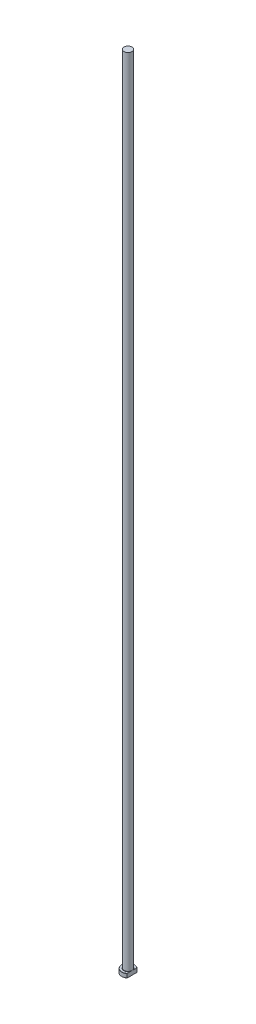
ISO-10303-21;
HEADER;
FILE_DESCRIPTION(('STEP AP214'),'2;1');
FILE_NAME('part.step','',(''),(''),'','','');
FILE_SCHEMA(('AUTOMOTIVE_DESIGN { 1 0 10303 214 1 1 1 1 }'));
ENDSEC;
DATA;
#1=APPLICATION_CONTEXT('core data for automotive mechanical design processes');
#2=APPLICATION_PROTOCOL_DEFINITION('international standard','automotive_design',2000,#1);
#3=PRODUCT_CONTEXT('',#1,'mechanical');
#4=PRODUCT('Part','Part','',(#3));
#5=PRODUCT_RELATED_PRODUCT_CATEGORY('part','',(#4));
#6=PRODUCT_DEFINITION_FORMATION('','',#4);
#7=PRODUCT_DEFINITION_CONTEXT('part definition',#1,'design');
#8=PRODUCT_DEFINITION('design','',#6,#7);
#9=PRODUCT_DEFINITION_SHAPE('','',#8);
#10=(LENGTH_UNIT() NAMED_UNIT(*) SI_UNIT(.MILLI.,.METRE.));
#11=(NAMED_UNIT(*) PLANE_ANGLE_UNIT() SI_UNIT($,.RADIAN.));
#12=(NAMED_UNIT(*) SI_UNIT($,.STERADIAN.) SOLID_ANGLE_UNIT());
#13=UNCERTAINTY_MEASURE_WITH_UNIT(LENGTH_MEASURE(1.E-05),#10,'distance_accuracy_value','');
#14=(GEOMETRIC_REPRESENTATION_CONTEXT(3) GLOBAL_UNCERTAINTY_ASSIGNED_CONTEXT((#13)) GLOBAL_UNIT_ASSIGNED_CONTEXT((#10,
#11,#12)) REPRESENTATION_CONTEXT('',''));
#15=CARTESIAN_POINT('',(0.,0.,0.));
#16=DIRECTION('',(0.,0.,1.));
#17=DIRECTION('',(1.,0.,0.));
#18=AXIS2_PLACEMENT_3D('',#15,#16,#17);
#19=CARTESIAN_POINT('',(0.,0.,0.));
#20=DIRECTION('',(0.,-1.,0.));
#21=DIRECTION('',(0.,0.,-1.));
#22=AXIS2_PLACEMENT_3D('',#19,#20,#21);
#23=PLANE('',#22);
#24=CARTESIAN_POINT('',(0.,0.,0.));
#25=DIRECTION('',(0.,-1.,0.));
#26=DIRECTION('',(0.,0.,-1.));
#27=AXIS2_PLACEMENT_3D('',#24,#25,#26);
#28=CIRCLE('',#27,7.79999999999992);
#29=CARTESIAN_POINT('',(4.99999999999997,0.,5.98665181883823));
#30=VERTEX_POINT('',#29);
#31=CARTESIAN_POINT('',(4.99999999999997,0.,-5.98665181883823));
#32=VERTEX_POINT('',#31);
#33=EDGE_CURVE('E98',#30,#32,#28,.T.);
#34=ORIENTED_EDGE('',*,*,#33,.T.);
#35=DIRECTION('',(0.,0.,1.));
#36=VECTOR('',#35,1.);
#37=CARTESIAN_POINT('',(4.99999999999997,0.,-6.24499799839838));
#38=LINE('',#37,#36);
#39=EDGE_CURVE('E83',#32,#30,#38,.T.);
#40=ORIENTED_EDGE('',*,*,#39,.T.);
#41=EDGE_LOOP('',(#34,#40));
#42=FACE_BOUND('',#41,.T.);
#43=ADVANCED_FACE('F32',(#42),#23,.T.);
#44=CARTESIAN_POINT('',(0.,259.958771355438,0.));
#45=DIRECTION('',(0.,1.,0.));
#46=DIRECTION('',(0.,0.,1.));
#47=AXIS2_PLACEMENT_3D('',#44,#45,#46);
#48=CYLINDRICAL_SURFACE('',#47,7.99999999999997);
#49=CARTESIAN_POINT('',(0.,4.80000000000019,0.));
#50=DIRECTION('',(0.,1.,0.));
#51=DIRECTION('',(0.,0.,1.));
#52=AXIS2_PLACEMENT_3D('',#49,#50,#51);
#53=CIRCLE('',#52,7.99999999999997);
#54=CARTESIAN_POINT('',(4.99999999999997,4.80000000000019,6.24499799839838));
#55=VERTEX_POINT('',#54);
#56=CARTESIAN_POINT('',(4.99999999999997,4.80000000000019,-6.24499799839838));
#57=VERTEX_POINT('',#56);
#58=EDGE_CURVE('E104',#55,#57,#53,.F.);
#59=ORIENTED_EDGE('',*,*,#58,.T.);
#60=DIRECTION('',(0.,-1.,0.));
#61=VECTOR('',#60,1.);
#62=CARTESIAN_POINT('',(4.99999999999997,1000.,-6.24499799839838));
#63=LINE('',#62,#61);
#64=CARTESIAN_POINT('',(4.99999999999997,0.200000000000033,-6.24499799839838));
#65=VERTEX_POINT('',#64);
#66=EDGE_CURVE('E183',#57,#65,#63,.T.);
#67=ORIENTED_EDGE('',*,*,#66,.T.);
#68=CARTESIAN_POINT('',(0.,0.200000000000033,0.));
#69=DIRECTION('',(0.,-1.,0.));
#70=DIRECTION('',(0.,0.,-1.));
#71=AXIS2_PLACEMENT_3D('',#68,#69,#70);
#72=CIRCLE('',#71,7.99999999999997);
#73=CARTESIAN_POINT('',(4.99999999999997,0.200000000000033,6.24499799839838));
#74=VERTEX_POINT('',#73);
#75=EDGE_CURVE('E100',#65,#74,#72,.F.);
#76=ORIENTED_EDGE('',*,*,#75,.T.);
#77=DIRECTION('',(0.,-1.,0.));
#78=VECTOR('',#77,1.);
#79=CARTESIAN_POINT('',(4.99999999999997,1000.,6.24499799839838));
#80=LINE('',#79,#78);
#81=EDGE_CURVE('E93',#55,#74,#80,.T.);
#82=ORIENTED_EDGE('',*,*,#81,.F.);
#83=EDGE_LOOP('',(#59,#67,#76,#82));
#84=FACE_BOUND('',#83,.T.);
#85=ADVANCED_FACE('F158',(#84),#48,.T.);
#86=CARTESIAN_POINT('',(-7.99999999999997,5.,0.));
#87=DIRECTION('',(0.,1.,0.));
#88=DIRECTION('',(0.,0.,1.));
#89=AXIS2_PLACEMENT_3D('',#86,#87,#88);
#90=PLANE('',#89);
#91=CARTESIAN_POINT('',(0.,5.,0.));
#92=DIRECTION('',(0.,1.,0.));
#93=DIRECTION('',(0.,0.,1.));
#94=AXIS2_PLACEMENT_3D('',#91,#92,#93);
#95=CIRCLE('',#94,7.80000000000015);
#96=CARTESIAN_POINT('',(4.99999999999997,5.,-5.98665181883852));
#97=VERTEX_POINT('',#96);
#98=CARTESIAN_POINT('',(4.99999999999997,5.,5.98665181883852));
#99=VERTEX_POINT('',#98);
#100=EDGE_CURVE('E178',#97,#99,#95,.T.);
#101=ORIENTED_EDGE('',*,*,#100,.T.);
#102=DIRECTION('',(0.,0.,-1.));
#103=VECTOR('',#102,1.);
#104=CARTESIAN_POINT('',(4.99999999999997,5.,0.));
#105=LINE('',#104,#103);
#106=CARTESIAN_POINT('',(4.99999999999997,4.99999999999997,1.75783958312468));
#107=VERTEX_POINT('',#106);
#108=EDGE_CURVE('E57',#99,#107,#105,.T.);
#109=ORIENTED_EDGE('',*,*,#108,.T.);
#110=CARTESIAN_POINT('',(0.,5.,0.));
#111=DIRECTION('',(0.,1.,0.));
#112=DIRECTION('',(0.,0.,1.));
#113=AXIS2_PLACEMENT_3D('',#110,#111,#112);
#114=CIRCLE('',#113,5.29999999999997);
#115=CARTESIAN_POINT('',(4.99999999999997,4.99999999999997,-1.75783958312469));
#116=VERTEX_POINT('',#115);
#117=EDGE_CURVE('E107',#107,#116,#114,.F.);
#118=ORIENTED_EDGE('',*,*,#117,.T.);
#119=EDGE_CURVE('E136',#116,#97,#105,.T.);
#120=ORIENTED_EDGE('',*,*,#119,.T.);
#121=EDGE_LOOP('',(#101,#109,#118,#120));
#122=FACE_BOUND('',#121,.T.);
#123=ADVANCED_FACE('F147',(#122),#90,.T.);
#124=CARTESIAN_POINT('',(0.,5.,0.));
#125=DIRECTION('',(0.,-1.,0.));
#126=DIRECTION('',(0.,0.,-1.));
#127=AXIS2_PLACEMENT_3D('',#124,#125,#126);
#128=CONICAL_SURFACE('',#127,7.80000000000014,0.785398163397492);
#129=ORIENTED_EDGE('',*,*,#58,.F.);
#130=CARTESIAN_POINT('',(4.99999999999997,-1.82162423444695,13.7401563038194));
#131=CARTESIAN_POINT('',(4.99999999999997,-1.61889813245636,13.5244204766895));
#132=CARTESIAN_POINT('',(4.99999999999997,-1.41646387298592,13.3084101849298));
#133=CARTESIAN_POINT('',(4.99999999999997,-1.01227657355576,12.8757508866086));
#134=CARTESIAN_POINT('',(4.99999999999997,-0.810523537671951,12.65910187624));
#135=CARTESIAN_POINT('',(4.99999999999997,-0.2061579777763,12.0077661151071));
#136=CARTESIAN_POINT('',(4.99999999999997,0.195280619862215,11.571988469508));
#137=CARTESIAN_POINT('',(4.99999999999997,1.0038828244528,10.6856136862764));
#138=CARTESIAN_POINT('',(4.99999999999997,1.4109390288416,10.234918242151));
#139=CARTESIAN_POINT('',(4.99999999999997,2.01658324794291,9.55471676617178));
#140=CARTESIAN_POINT('',(4.99999999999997,2.21758236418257,9.32735800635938));
#141=CARTESIAN_POINT('',(4.99999999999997,2.61761142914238,8.87091599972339));
#142=CARTESIAN_POINT('',(4.99999999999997,2.81664139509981,8.6418327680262));
#143=CARTESIAN_POINT('',(4.99999999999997,3.21217345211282,8.18170099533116));
#144=CARTESIAN_POINT('',(4.99999999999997,3.40867681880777,7.95065355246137));
#145=CARTESIAN_POINT('',(4.99999999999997,3.79865427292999,7.48599989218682));
#146=CARTESIAN_POINT('',(4.99999999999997,3.99212827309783,7.25239360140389));
#147=CARTESIAN_POINT('',(4.99999999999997,4.37558160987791,6.78155890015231));
#148=CARTESIAN_POINT('',(4.99999999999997,4.56555334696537,6.54432428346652));
#149=CARTESIAN_POINT('',(4.99999999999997,4.94042138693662,6.065895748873));
#150=CARTESIAN_POINT('',(4.99999999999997,5.12531810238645,5.82470215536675));
#151=CARTESIAN_POINT('',(4.99999999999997,5.48653546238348,5.33972956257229));
#152=CARTESIAN_POINT('',(4.99999999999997,5.66292392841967,5.09600137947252));
#153=CARTESIAN_POINT('',(4.99999999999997,6.00675382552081,4.60213647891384));
#154=CARTESIAN_POINT('',(4.99999999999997,6.17419169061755,4.35199726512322));
#155=CARTESIAN_POINT('',(4.99999999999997,6.495929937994,3.84445040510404));
#156=CARTESIAN_POINT('',(4.99999999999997,6.65027272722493,3.5870701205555));
#157=CARTESIAN_POINT('',(4.99999999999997,6.86813414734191,3.19356592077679));
#158=CARTESIAN_POINT('',(4.99999999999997,6.93845533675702,3.06120993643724));
#159=CARTESIAN_POINT('',(4.99999999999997,7.07360441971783,2.7937331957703));
#160=CARTESIAN_POINT('',(4.99999999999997,7.13843319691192,2.65861288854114));
#161=CARTESIAN_POINT('',(4.99999999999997,7.26869642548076,2.36936389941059));
#162=CARTESIAN_POINT('',(4.99999999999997,7.33331212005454,2.21486278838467));
#163=CARTESIAN_POINT('',(4.99999999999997,7.45243473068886,1.90194073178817));
#164=CARTESIAN_POINT('',(4.99999999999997,7.50694001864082,1.74351915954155));
#165=CARTESIAN_POINT('',(4.99999999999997,7.60343746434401,1.42384276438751));
#166=CARTESIAN_POINT('',(4.99999999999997,7.64549910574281,1.26260921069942));
#167=CARTESIAN_POINT('',(4.99999999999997,7.71543089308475,0.93706224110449));
#168=CARTESIAN_POINT('',(4.99999999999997,7.74330266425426,0.772749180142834));
#169=CARTESIAN_POINT('',(4.99999999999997,7.78344284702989,0.439876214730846));
#170=CARTESIAN_POINT('',(4.99999999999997,7.79548961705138,0.271289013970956));
#171=CARTESIAN_POINT('',(4.99999999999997,7.80240809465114,-0.0662275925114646));
#172=CARTESIAN_POINT('',(4.99999999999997,7.79728142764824,-0.235156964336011));
#173=CARTESIAN_POINT('',(4.99999999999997,7.77017954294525,-0.572209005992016));
#174=CARTESIAN_POINT('',(4.99999999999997,7.74814735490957,-0.74032700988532));
#175=CARTESIAN_POINT('',(4.99999999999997,7.68863212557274,-1.07379849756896));
#176=CARTESIAN_POINT('',(4.99999999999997,7.65114437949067,-1.23915112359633));
#177=CARTESIAN_POINT('',(4.99999999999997,7.54734433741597,-1.62344926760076));
#178=CARTESIAN_POINT('',(4.99999999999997,7.47553580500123,-1.84089917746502));
#179=CARTESIAN_POINT('',(4.99999999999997,7.31300119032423,-2.26856946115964));
#180=CARTESIAN_POINT('',(4.99999999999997,7.22226460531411,-2.47878574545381));
#181=CARTESIAN_POINT('',(4.99999999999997,7.07492970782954,-2.79014067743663));
#182=CARTESIAN_POINT('',(4.99999999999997,7.02362278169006,-2.89384077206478));
#183=CARTESIAN_POINT('',(4.99999999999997,6.91783840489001,-3.09961626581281));
#184=CARTESIAN_POINT('',(4.99999999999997,6.86336091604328,-3.20169164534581));
#185=CARTESIAN_POINT('',(4.99999999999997,6.75169048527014,-3.40428995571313));
#186=CARTESIAN_POINT('',(4.99999999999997,6.69449856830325,-3.50481345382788));
#187=CARTESIAN_POINT('',(4.99999999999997,6.57774196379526,-3.70446206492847));
#188=CARTESIAN_POINT('',(4.99999999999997,6.51817739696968,-3.80358724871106));
#189=CARTESIAN_POINT('',(4.99999999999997,6.30853654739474,-4.1443576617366));
#190=CARTESIAN_POINT('',(4.99999999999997,6.15326588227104,-4.3828135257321));
#191=CARTESIAN_POINT('',(4.99999999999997,5.83377190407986,-4.85367607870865));
#192=CARTESIAN_POINT('',(4.99999999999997,5.6695459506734,-5.08608095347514));
#193=CARTESIAN_POINT('',(4.99999999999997,5.33431698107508,-5.5462855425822));
#194=CARTESIAN_POINT('',(4.99999999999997,5.16330740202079,-5.77408045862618));
#195=CARTESIAN_POINT('',(4.99999999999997,4.8162992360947,-6.22578157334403));
#196=CARTESIAN_POINT('',(4.99999999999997,4.64030119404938,-6.44968819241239));
#197=CARTESIAN_POINT('',(4.99999999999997,4.28368615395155,-6.89532578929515));
#198=CARTESIAN_POINT('',(4.99999999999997,4.10305289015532,-7.11704371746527));
#199=CARTESIAN_POINT('',(4.99999999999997,3.73870710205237,-7.55793799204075));
#200=CARTESIAN_POINT('',(4.99999999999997,3.55499450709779,-7.77711427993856));
#201=CARTESIAN_POINT('',(4.99999999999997,3.18521083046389,-8.21325328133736));
#202=CARTESIAN_POINT('',(4.99999999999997,2.99914113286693,-8.43021717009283));
#203=CARTESIAN_POINT('',(4.99999999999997,2.62499812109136,-8.86241167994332));
#204=CARTESIAN_POINT('',(4.99999999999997,2.43692478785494,-9.07764228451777));
#205=CARTESIAN_POINT('',(4.99999999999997,1.91463404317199,-9.67075518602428));
#206=CARTESIAN_POINT('',(4.99999999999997,1.578680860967,-10.0471086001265));
#207=CARTESIAN_POINT('',(4.99999999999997,0.903003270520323,-10.7965122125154));
#208=CARTESIAN_POINT('',(4.99999999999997,0.563278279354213,-11.1695618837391));
#209=CARTESIAN_POINT('',(4.99999999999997,-0.116149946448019,-11.9100168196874));
#210=CARTESIAN_POINT('',(4.99999999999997,-0.455830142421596,-12.2774432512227));
#211=CARTESIAN_POINT('',(4.99999999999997,-1.13728640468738,-13.0102135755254));
#212=CARTESIAN_POINT('',(4.99999999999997,-1.47906204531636,-13.3755578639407));
#213=CARTESIAN_POINT('',(4.99999999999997,-1.82162423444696,-13.7401563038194));
#214=B_SPLINE_CURVE_WITH_KNOTS('',3,(#130,#131,#132,#133,#134,#135,#136,#137,#138,#139,#140,
#141,#142,#143,#144,#145,#146,#147,#148,#149,#150,#151,#152,#153,#154,#155,#156,#157,#158,#159,
#160,#161,#162,#163,#164,#165,#166,#167,#168,#169,#170,#171,#172,#173,#174,#175,#176,#177,#178,
#179,#180,#181,#182,#183,#184,#185,#186,#187,#188,#189,#190,#191,#192,#193,#194,#195,#196,#197,
#198,#199,#200,#201,#202,#203,#204,#205,#206,#207,#208,#209,#210,#211,#212,#213),.UNSPECIFIED.,
.F.,.F.,(4,2,2,2,2,2,2,2,2,2,2,2,2,2,2,2,2,2,2,2,2,2,2,2,2,2,2,2,2,2,2,2,2,2,2,2,2,2,2,2,2,4),
(0.,0.888120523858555,1.77624635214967,3.55372511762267,5.37559481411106,6.28598924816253,
7.19637570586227,8.10628289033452,9.01621623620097,9.92793449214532,10.8395784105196,
11.7420025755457,12.6447836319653,13.5445196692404,13.9940505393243,14.4435089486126,
14.9456212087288,15.4478142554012,15.947147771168,16.4464240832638,16.9526211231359,
17.4587702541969,17.966632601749,18.4746496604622,19.1604516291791,19.8466351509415,
20.1936870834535,20.5407431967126,20.8876692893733,21.2345777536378,22.0879097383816,
22.9414946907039,23.7959266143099,24.6502655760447,25.5081848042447,26.3661237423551,
27.2235803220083,28.0810450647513,29.5944656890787,31.1081235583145,32.6092678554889,
34.1101167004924),.UNSPECIFIED.);
#215=EDGE_CURVE('E135',#55,#99,#214,.T.);
#216=ORIENTED_EDGE('',*,*,#215,.T.);
#217=ORIENTED_EDGE('',*,*,#100,.F.);
#218=EDGE_CURVE('E127',#97,#57,#214,.T.);
#219=ORIENTED_EDGE('',*,*,#218,.T.);
#220=EDGE_LOOP('',(#129,#216,#217,#219));
#221=FACE_BOUND('',#220,.T.);
#222=ADVANCED_FACE('F143',(#221),#128,.T.);
#223=CARTESIAN_POINT('',(0.,0.200000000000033,0.));
#224=DIRECTION('',(0.,1.,0.));
#225=DIRECTION('',(0.,0.,1.));
#226=AXIS2_PLACEMENT_3D('',#223,#224,#225);
#227=CONICAL_SURFACE('',#226,7.99999999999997,0.785398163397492);
#228=ORIENTED_EDGE('',*,*,#75,.F.);
#229=CARTESIAN_POINT('',(4.99999999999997,6.82162423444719,-13.7401563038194));
#230=CARTESIAN_POINT('',(4.99999999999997,6.61889813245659,-13.5244204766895));
#231=CARTESIAN_POINT('',(4.99999999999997,6.41646387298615,-13.3084101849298));
#232=CARTESIAN_POINT('',(4.99999999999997,6.01227657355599,-12.8757508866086));
#233=CARTESIAN_POINT('',(4.99999999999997,5.81052353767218,-12.65910187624));
#234=CARTESIAN_POINT('',(4.99999999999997,5.20615797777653,-12.0077661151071));
#235=CARTESIAN_POINT('',(4.99999999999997,4.80471938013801,-11.571988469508));
#236=CARTESIAN_POINT('',(4.99999999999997,3.99611717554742,-10.6856136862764));
#237=CARTESIAN_POINT('',(4.99999999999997,3.58906097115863,-10.234918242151));
#238=CARTESIAN_POINT('',(4.99999999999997,2.98341675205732,-9.55471676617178));
#239=CARTESIAN_POINT('',(4.99999999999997,2.78241763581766,-9.32735800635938));
#240=CARTESIAN_POINT('',(4.99999999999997,2.38238857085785,-8.87091599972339));
#241=CARTESIAN_POINT('',(4.99999999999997,2.18335860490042,-8.6418327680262));
#242=CARTESIAN_POINT('',(4.99999999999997,1.78782654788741,-8.18170099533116));
#243=CARTESIAN_POINT('',(4.99999999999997,1.59132318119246,-7.95065355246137));
#244=CARTESIAN_POINT('',(4.99999999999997,1.20134572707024,-7.48599989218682));
#245=CARTESIAN_POINT('',(4.99999999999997,1.00787172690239,-7.25239360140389));
#246=CARTESIAN_POINT('',(4.99999999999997,0.62441839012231,-6.78155890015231));
#247=CARTESIAN_POINT('',(4.99999999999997,0.434446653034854,-6.54432428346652));
#248=CARTESIAN_POINT('',(4.99999999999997,0.0595786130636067,-6.06589574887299));
#249=CARTESIAN_POINT('',(4.99999999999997,-0.12531810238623,-5.82470215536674));
#250=CARTESIAN_POINT('',(4.99999999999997,-0.486535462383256,-5.33972956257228));
#251=CARTESIAN_POINT('',(4.99999999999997,-0.662923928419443,-5.09600137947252));
#252=CARTESIAN_POINT('',(4.99999999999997,-1.00675382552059,-4.60213647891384));
#253=CARTESIAN_POINT('',(4.99999999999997,-1.17419169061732,-4.35199726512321));
#254=CARTESIAN_POINT('',(4.99999999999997,-1.49592993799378,-3.84445040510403));
#255=CARTESIAN_POINT('',(4.99999999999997,-1.65027272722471,-3.5870701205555));
#256=CARTESIAN_POINT('',(4.99999999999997,-1.86813414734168,-3.19356592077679));
#257=CARTESIAN_POINT('',(4.99999999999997,-1.93845533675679,-3.06120993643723));
#258=CARTESIAN_POINT('',(4.99999999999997,-2.07360441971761,-2.7937331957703));
#259=CARTESIAN_POINT('',(4.99999999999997,-2.1384331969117,-2.65861288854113));
#260=CARTESIAN_POINT('',(4.99999999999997,-2.26869642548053,-2.36936389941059));
#261=CARTESIAN_POINT('',(4.99999999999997,-2.33331212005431,-2.21486278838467));
#262=CARTESIAN_POINT('',(4.99999999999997,-2.45243473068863,-1.90194073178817));
#263=CARTESIAN_POINT('',(4.99999999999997,-2.50694001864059,-1.74351915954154));
#264=CARTESIAN_POINT('',(4.99999999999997,-2.60343746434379,-1.42384276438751));
#265=CARTESIAN_POINT('',(4.99999999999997,-2.64549910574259,-1.26260921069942));
#266=CARTESIAN_POINT('',(4.99999999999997,-2.71543089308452,-0.937062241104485));
#267=CARTESIAN_POINT('',(4.99999999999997,-2.74330266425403,-0.772749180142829));
#268=CARTESIAN_POINT('',(4.99999999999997,-2.78344284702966,-0.439876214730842));
#269=CARTESIAN_POINT('',(4.99999999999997,-2.79548961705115,-0.271289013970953));
#270=CARTESIAN_POINT('',(4.99999999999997,-2.80240809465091,0.0662275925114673));
#271=CARTESIAN_POINT('',(4.99999999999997,-2.79728142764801,0.235156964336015));
#272=CARTESIAN_POINT('',(4.99999999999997,-2.77017954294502,0.572209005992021));
#273=CARTESIAN_POINT('',(4.99999999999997,-2.74814735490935,0.740327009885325));
#274=CARTESIAN_POINT('',(4.99999999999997,-2.68863212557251,1.07379849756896));
#275=CARTESIAN_POINT('',(4.99999999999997,-2.65114437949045,1.23915112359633));
#276=CARTESIAN_POINT('',(4.99999999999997,-2.54734433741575,1.62344926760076));
#277=CARTESIAN_POINT('',(4.99999999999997,-2.475535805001,1.84089917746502));
#278=CARTESIAN_POINT('',(4.99999999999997,-2.31300119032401,2.26856946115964));
#279=CARTESIAN_POINT('',(4.99999999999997,-2.22226460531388,2.47878574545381));
#280=CARTESIAN_POINT('',(4.99999999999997,-2.07492970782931,2.79014067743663));
#281=CARTESIAN_POINT('',(4.99999999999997,-2.02362278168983,2.89384077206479));
#282=CARTESIAN_POINT('',(4.99999999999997,-1.91783840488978,3.09961626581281));
#283=CARTESIAN_POINT('',(4.99999999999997,-1.86336091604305,3.20169164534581));
#284=CARTESIAN_POINT('',(4.99999999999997,-1.75169048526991,3.40428995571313));
#285=CARTESIAN_POINT('',(4.99999999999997,-1.69449856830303,3.50481345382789));
#286=CARTESIAN_POINT('',(4.99999999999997,-1.57774196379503,3.70446206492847));
#287=CARTESIAN_POINT('',(4.99999999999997,-1.51817739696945,3.80358724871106));
#288=CARTESIAN_POINT('',(4.99999999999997,-1.30853654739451,4.14435766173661));
#289=CARTESIAN_POINT('',(4.99999999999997,-1.15326588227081,4.38281352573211));
#290=CARTESIAN_POINT('',(4.99999999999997,-0.833771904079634,4.85367607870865));
#291=CARTESIAN_POINT('',(4.99999999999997,-0.669545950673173,5.08608095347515));
#292=CARTESIAN_POINT('',(4.99999999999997,-0.334316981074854,5.5462855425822));
#293=CARTESIAN_POINT('',(4.99999999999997,-0.163307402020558,5.77408045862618));
#294=CARTESIAN_POINT('',(4.99999999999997,0.183700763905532,6.22578157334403));
#295=CARTESIAN_POINT('',(4.99999999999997,0.359698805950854,6.4496881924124));
#296=CARTESIAN_POINT('',(4.99999999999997,0.716313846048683,6.89532578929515));
#297=CARTESIAN_POINT('',(4.99999999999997,0.896947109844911,7.11704371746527));
#298=CARTESIAN_POINT('',(4.99999999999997,1.26129289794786,7.55793799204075));
#299=CARTESIAN_POINT('',(4.99999999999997,1.44500549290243,7.77711427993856));
#300=CARTESIAN_POINT('',(4.99999999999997,1.81478916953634,8.21325328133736));
#301=CARTESIAN_POINT('',(4.99999999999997,2.0008588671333,8.43021717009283));
#302=CARTESIAN_POINT('',(4.99999999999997,2.37500187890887,8.86241167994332));
#303=CARTESIAN_POINT('',(4.99999999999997,2.56307521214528,9.07764228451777));
#304=CARTESIAN_POINT('',(4.99999999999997,3.08536595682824,9.67075518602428));
#305=CARTESIAN_POINT('',(4.99999999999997,3.42131913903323,10.0471086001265));
#306=CARTESIAN_POINT('',(4.99999999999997,4.0969967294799,10.7965122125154));
#307=CARTESIAN_POINT('',(4.99999999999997,4.43672172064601,11.1695618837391));
#308=CARTESIAN_POINT('',(4.99999999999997,5.11614994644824,11.9100168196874));
#309=CARTESIAN_POINT('',(4.99999999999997,5.45583014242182,12.2774432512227));
#310=CARTESIAN_POINT('',(4.99999999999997,6.13728640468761,13.0102135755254));
#311=CARTESIAN_POINT('',(4.99999999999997,6.47906204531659,13.3755578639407));
#312=CARTESIAN_POINT('',(4.99999999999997,6.82162423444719,13.7401563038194));
#313=B_SPLINE_CURVE_WITH_KNOTS('',3,(#229,#230,#231,#232,#233,#234,#235,#236,#237,#238,#239,
#240,#241,#242,#243,#244,#245,#246,#247,#248,#249,#250,#251,#252,#253,#254,#255,#256,#257,#258,
#259,#260,#261,#262,#263,#264,#265,#266,#267,#268,#269,#270,#271,#272,#273,#274,#275,#276,#277,
#278,#279,#280,#281,#282,#283,#284,#285,#286,#287,#288,#289,#290,#291,#292,#293,#294,#295,#296,
#297,#298,#299,#300,#301,#302,#303,#304,#305,#306,#307,#308,#309,#310,#311,#312),.UNSPECIFIED.,
.F.,.F.,(4,2,2,2,2,2,2,2,2,2,2,2,2,2,2,2,2,2,2,2,2,2,2,2,2,2,2,2,2,2,2,2,2,2,2,2,2,2,2,2,2,4),
(0.,0.888120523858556,1.77624635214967,3.55372511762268,5.37559481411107,6.28598924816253,
7.19637570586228,8.10628289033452,9.01621623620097,9.92793449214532,10.8395784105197,
11.7420025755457,12.6447836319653,13.5445196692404,13.9940505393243,14.4435089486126,
14.9456212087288,15.4478142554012,15.947147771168,16.4464240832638,16.952621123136,
17.4587702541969,17.966632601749,18.4746496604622,19.1604516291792,19.8466351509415,
20.1936870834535,20.5407431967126,20.8876692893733,21.2345777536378,22.0879097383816,
22.9414946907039,23.79592661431,24.6502655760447,25.5081848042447,26.3661237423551,
27.2235803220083,28.0810450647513,29.5944656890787,31.1081235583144,32.6092678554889,
34.1101167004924),.UNSPECIFIED.);
#314=EDGE_CURVE('E86',#65,#32,#313,.T.);
#315=ORIENTED_EDGE('',*,*,#314,.T.);
#316=ORIENTED_EDGE('',*,*,#33,.F.);
#317=EDGE_CURVE('E89',#30,#74,#313,.T.);
#318=ORIENTED_EDGE('',*,*,#317,.T.);
#319=EDGE_LOOP('',(#228,#315,#316,#318));
#320=FACE_BOUND('',#319,.T.);
#321=ADVANCED_FACE('F97',(#320),#227,.T.);
#322=CARTESIAN_POINT('',(0.,5.29999999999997,0.));
#323=DIRECTION('',(0.,1.,0.));
#324=DIRECTION('',(0.,0.,1.));
#325=AXIS2_PLACEMENT_3D('',#322,#323,#324);
#326=TOROIDAL_SURFACE('',#325,5.29999999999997,0.3);
#327=CARTESIAN_POINT('',(4.99999999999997,5.29999999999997,0.));
#328=CARTESIAN_POINT('',(4.99999999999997,5.30000062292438,1.31470000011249E-10));
#329=CARTESIAN_POINT('',(4.99999999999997,5.30000124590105,-2.52759208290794E-07));
#330=CARTESIAN_POINT('',(4.99999999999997,5.30000240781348,-9.4716432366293E-07));
#331=CARTESIAN_POINT('',(4.99999999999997,5.30000293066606,-1.40594035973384E-06));
#332=CARTESIAN_POINT('',(4.99999999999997,5.30000402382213,-2.50637603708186E-06));
#333=CARTESIAN_POINT('',(4.99999999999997,5.30000457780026,-3.16588904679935E-06));
#334=CARTESIAN_POINT('',(4.99999999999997,5.30000556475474,-4.52859961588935E-06));
#335=CARTESIAN_POINT('',(4.99999999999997,5.30000600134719,-5.22939444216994E-06));
#336=CARTESIAN_POINT('',(4.99999999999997,5.30000763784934,-7.96121978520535E-06));
#337=CARTESIAN_POINT('',(4.99999999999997,5.30000875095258,-1.0047740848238E-05));
#338=CARTESIAN_POINT('',(4.99999999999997,5.30001056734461,-1.41660873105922E-05));
#339=CARTESIAN_POINT('',(4.99999999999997,5.30001129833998,-1.61861783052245E-05));
#340=CARTESIAN_POINT('',(4.99999999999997,5.30001439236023,-2.47865739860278E-05));
#341=CARTESIAN_POINT('',(4.99999999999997,5.30001672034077,-3.1383028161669E-05));
#342=CARTESIAN_POINT('',(4.99999999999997,5.30002012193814,-4.38084218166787E-05));
#343=CARTESIAN_POINT('',(4.99999999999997,5.30002133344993,-4.95992736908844E-05));
#344=CARTESIAN_POINT('',(4.99999999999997,5.30003020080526,-9.27862610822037E-05));
#345=CARTESIAN_POINT('',(4.99999999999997,5.30003696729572,-0.000130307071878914));
#346=CARTESIAN_POINT('',(4.99999999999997,5.30006659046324,-0.000278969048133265));
#347=CARTESIAN_POINT('',(4.99999999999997,5.30009481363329,-0.000389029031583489));
#348=CARTESIAN_POINT('',(4.99999999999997,5.3002050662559,-0.000826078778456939));
#349=CARTESIAN_POINT('',(4.99999999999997,5.30028365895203,-0.0011536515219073));
#350=CARTESIAN_POINT('',(4.99999999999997,5.300599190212,-0.0024592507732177));
#351=CARTESIAN_POINT('',(4.99999999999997,5.30084048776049,-0.00343651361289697));
#352=CARTESIAN_POINT('',(4.99999999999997,5.3018462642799,-0.00752058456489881));
#353=CARTESIAN_POINT('',(4.99999999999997,5.3026052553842,-0.0106283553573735));
#354=CARTESIAN_POINT('',(4.99999999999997,5.30996461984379,-0.0407482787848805));
#355=CARTESIAN_POINT('',(4.99999999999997,5.31658985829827,-0.0677561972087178));
#356=CARTESIAN_POINT('',(4.99999999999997,5.32953319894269,-0.120688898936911));
#357=CARTESIAN_POINT('',(4.99999999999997,5.33585289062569,-0.146613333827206));
#358=CARTESIAN_POINT('',(4.99999999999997,5.34926050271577,-0.201795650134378));
#359=CARTESIAN_POINT('',(4.99999999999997,5.35634306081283,-0.231054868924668));
#360=CARTESIAN_POINT('',(4.99999999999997,5.37050252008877,-0.289917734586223));
#361=CARTESIAN_POINT('',(4.99999999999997,5.37757848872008,-0.319521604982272));
#362=CARTESIAN_POINT('',(4.99999999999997,5.39452602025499,-0.391032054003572));
#363=CARTESIAN_POINT('',(4.99999999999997,5.40434071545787,-0.432952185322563));
#364=CARTESIAN_POINT('',(4.99999999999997,5.42340141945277,-0.51576321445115));
#365=CARTESIAN_POINT('',(4.99999999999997,5.43265559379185,-0.556652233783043));
#366=CARTESIAN_POINT('',(4.99999999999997,5.45710553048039,-0.667075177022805));
#367=CARTESIAN_POINT('',(4.99999999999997,5.47194176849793,-0.736689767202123));
#368=CARTESIAN_POINT('',(4.99999999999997,5.50018229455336,-0.876836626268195));
#369=CARTESIAN_POINT('',(4.99999999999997,5.51357312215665,-0.947371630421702));
#370=CARTESIAN_POINT('',(4.99999999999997,5.53930921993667,-1.09497328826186));
#371=CARTESIAN_POINT('',(4.99999999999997,5.55146217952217,-1.17207432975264));
#372=CARTESIAN_POINT('',(4.99999999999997,5.57239669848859,-1.32672649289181));
#373=CARTESIAN_POINT('',(4.99999999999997,5.58117877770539,-1.40427754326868));
#374=CARTESIAN_POINT('',(4.99999999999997,5.594997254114,-1.5687382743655));
#375=CARTESIAN_POINT('',(4.99999999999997,5.59948802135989,-1.65570044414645));
#376=CARTESIAN_POINT('',(4.99999999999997,5.60018885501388,-1.78535304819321));
#377=CARTESIAN_POINT('',(4.99999999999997,5.59945214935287,-1.82802575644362));
#378=CARTESIAN_POINT('',(4.99999999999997,5.59559364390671,-1.91325081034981));
#379=CARTESIAN_POINT('',(4.99999999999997,5.59247319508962,-1.95580321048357));
#380=CARTESIAN_POINT('',(4.99999999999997,5.5838324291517,-2.03512365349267));
#381=CARTESIAN_POINT('',(4.99999999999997,5.57867386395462,-2.07192937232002));
#382=CARTESIAN_POINT('',(4.99999999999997,5.56543793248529,-2.1452675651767));
#383=CARTESIAN_POINT('',(4.99999999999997,5.55734203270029,-2.18179676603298));
#384=CARTESIAN_POINT('',(4.99999999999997,5.53718005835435,-2.25427226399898));
#385=CARTESIAN_POINT('',(4.99999999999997,5.52507057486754,-2.29020746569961));
#386=CARTESIAN_POINT('',(4.99999999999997,5.50270928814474,-2.34223029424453));
#387=CARTESIAN_POINT('',(4.99999999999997,5.4945781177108,-2.35922314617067));
#388=CARTESIAN_POINT('',(4.99999999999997,5.47657809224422,-2.39224900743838));
#389=CARTESIAN_POINT('',(4.99999999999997,5.46671281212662,-2.40828390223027));
#390=CARTESIAN_POINT('',(4.99999999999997,5.44695893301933,-2.43579467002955));
#391=CARTESIAN_POINT('',(4.99999999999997,5.4374587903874,-2.44754592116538));
#392=CARTESIAN_POINT('',(4.99999999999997,5.41677914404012,-2.46946476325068));
#393=CARTESIAN_POINT('',(4.99999999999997,5.40560543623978,-2.47963758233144));
#394=CARTESIAN_POINT('',(4.99999999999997,5.38617750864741,-2.49393642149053));
#395=CARTESIAN_POINT('',(4.99999999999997,5.37851643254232,-2.49886271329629));
#396=CARTESIAN_POINT('',(4.99999999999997,5.36252740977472,-2.50749953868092));
#397=CARTESIAN_POINT('',(4.99999999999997,5.35419984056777,-2.51121075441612));
#398=CARTESIAN_POINT('',(4.99999999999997,5.33690648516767,-2.51712941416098));
#399=CARTESIAN_POINT('',(4.99999999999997,5.3279345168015,-2.51931927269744));
#400=CARTESIAN_POINT('',(4.99999999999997,5.30973576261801,-2.52185978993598));
#401=CARTESIAN_POINT('',(4.99999999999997,5.30050931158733,-2.52221275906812));
#402=CARTESIAN_POINT('',(4.99999999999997,5.28349166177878,-2.52112455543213));
#403=CARTESIAN_POINT('',(4.99999999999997,5.27568322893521,-2.519931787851));
#404=CARTESIAN_POINT('',(4.99999999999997,5.26036860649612,-2.51628294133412));
#405=CARTESIAN_POINT('',(4.99999999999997,5.25286261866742,-2.51382603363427));
#406=CARTESIAN_POINT('',(4.99999999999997,5.23590266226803,-2.50685484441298));
#407=CARTESIAN_POINT('',(4.99999999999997,5.22661875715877,-2.50192984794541));
#408=CARTESIAN_POINT('',(4.99999999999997,5.20895514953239,-2.49066548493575));
#409=CARTESIAN_POINT('',(4.99999999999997,5.20057756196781,-2.48432291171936));
#410=CARTESIAN_POINT('',(4.99999999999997,5.1798700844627,-2.46645212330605));
#411=CARTESIAN_POINT('',(4.99999999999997,5.1682415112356,-2.45411867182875));
#412=CARTESIAN_POINT('',(4.99999999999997,5.14692461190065,-2.42790849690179));
#413=CARTESIAN_POINT('',(4.99999999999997,5.13723987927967,-2.41402898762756));
#414=CARTESIAN_POINT('',(4.99999999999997,5.11080706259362,-2.37143175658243));
#415=CARTESIAN_POINT('',(4.99999999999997,5.09628770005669,-2.34134703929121));
#416=CARTESIAN_POINT('',(4.99999999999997,5.07130349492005,-2.27940731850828));
#417=CARTESIAN_POINT('',(4.99999999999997,5.06087110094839,-2.24754035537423));
#418=CARTESIAN_POINT('',(4.99999999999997,5.03890359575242,-2.16787245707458));
#419=CARTESIAN_POINT('',(4.99999999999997,5.02913523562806,-2.1195906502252));
#420=CARTESIAN_POINT('',(4.99999999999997,5.01416953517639,-2.02224928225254));
#421=CARTESIAN_POINT('',(4.99999999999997,5.00898637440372,-1.97318778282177));
#422=CARTESIAN_POINT('',(4.99999999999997,5.00220823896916,-1.87635767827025));
#423=CARTESIAN_POINT('',(4.99999999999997,5.00050709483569,-1.82859609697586));
#424=CARTESIAN_POINT('',(4.99999999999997,4.99969104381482,-1.73330165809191));
#425=CARTESIAN_POINT('',(4.99999999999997,5.00056327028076,-1.68576884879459));
#426=CARTESIAN_POINT('',(4.99999999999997,5.0048429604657,-1.57937770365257));
#427=CARTESIAN_POINT('',(4.99999999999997,5.00880932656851,-1.52054285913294));
#428=CARTESIAN_POINT('',(4.99999999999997,5.01925964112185,-1.40312974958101));
#429=CARTESIAN_POINT('',(4.99999999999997,5.02574264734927,-1.34455139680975));
#430=CARTESIAN_POINT('',(4.99999999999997,5.04090087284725,-1.22627662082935));
#431=CARTESIAN_POINT('',(4.99999999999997,5.0496242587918,-1.16658647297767));
#432=CARTESIAN_POINT('',(4.99999999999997,5.06877923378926,-1.04732463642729));
#433=CARTESIAN_POINT('',(4.99999999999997,5.07921523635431,-0.987753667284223));
#434=CARTESIAN_POINT('',(4.99999999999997,5.10551698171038,-0.846936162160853));
#435=CARTESIAN_POINT('',(4.99999999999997,5.12196565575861,-0.765799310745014));
#436=CARTESIAN_POINT('',(4.99999999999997,5.15639716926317,-0.604819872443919));
#437=CARTESIAN_POINT('',(4.99999999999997,5.17436050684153,-0.524973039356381));
#438=CARTESIAN_POINT('',(4.99999999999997,5.20921667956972,-0.374726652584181));
#439=CARTESIAN_POINT('',(4.99999999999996,5.22599388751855,-0.304300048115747));
#440=CARTESIAN_POINT('',(4.99999999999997,5.2519110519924,-0.196907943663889));
#441=CARTESIAN_POINT('',(4.99999999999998,5.26090146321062,-0.159905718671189));
#442=CARTESIAN_POINT('',(4.99999999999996,5.27881854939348,-0.0865164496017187));
#443=CARTESIAN_POINT('',(4.99999999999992,5.28774391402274,-0.0501291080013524));
#444=CARTESIAN_POINT('',(4.99999999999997,5.29739627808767,-0.0106218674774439));
#445=CARTESIAN_POINT('',(4.99999999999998,5.2981568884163,-0.00750762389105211));
#446=CARTESIAN_POINT('',(4.99999999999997,5.2991630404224,-0.00342209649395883));
#447=CARTESIAN_POINT('',(4.99999999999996,5.29940309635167,-0.00244985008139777));
#448=CARTESIAN_POINT('',(4.99999999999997,5.29971711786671,-0.00115049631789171));
#449=CARTESIAN_POINT('',(4.99999999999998,5.299795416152,-0.000824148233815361));
#450=CARTESIAN_POINT('',(4.99999999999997,5.2999053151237,-0.000388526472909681));
#451=CARTESIAN_POINT('',(4.99999999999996,5.29993348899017,-0.0002786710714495));
#452=CARTESIAN_POINT('',(4.99999999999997,5.29996306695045,-0.000130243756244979));
#453=CARTESIAN_POINT('',(4.99999999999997,5.29996982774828,-9.2751137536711E-05));
#454=CARTESIAN_POINT('',(4.99999999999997,5.29997868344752,-4.95929887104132E-05));
#455=CARTESIAN_POINT('',(4.99999999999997,5.29997989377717,-4.38036553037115E-05));
#456=CARTESIAN_POINT('',(4.99999999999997,5.29998329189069,-3.13814183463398E-05));
#457=CARTESIAN_POINT('',(4.99999999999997,5.29998561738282,-2.4786521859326E-05));
#458=CARTESIAN_POINT('',(4.99999999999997,5.29998870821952,-1.61877546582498E-05));
#459=CARTESIAN_POINT('',(4.99999999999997,5.29998943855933,-1.41677768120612E-05));
#460=CARTESIAN_POINT('',(4.99999999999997,5.29999125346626,-1.00495530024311E-05));
#461=CARTESIAN_POINT('',(4.99999999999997,5.29999236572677,-7.96302653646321E-06));
#462=CARTESIAN_POINT('',(4.99999999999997,5.29999400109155,-5.23107415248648E-06));
#463=CARTESIAN_POINT('',(4.99999999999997,5.29999443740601,-4.53021031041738E-06));
#464=CARTESIAN_POINT('',(4.99999999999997,5.29999542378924,-3.16731152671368E-06));
#465=CARTESIAN_POINT('',(4.99999999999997,5.29999597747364,-2.50767725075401E-06));
#466=CARTESIAN_POINT('',(4.99999999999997,5.29999707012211,-1.40695877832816E-06));
#467=CARTESIAN_POINT('',(4.99999999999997,5.29999759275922,-9.48032431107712E-07));
#468=CARTESIAN_POINT('',(4.99999999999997,5.29999875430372,-2.53244317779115E-07));
#469=CARTESIAN_POINT('',(4.99999999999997,5.29999937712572,-1.3145941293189E-10));
#470=CARTESIAN_POINT('',(4.99999999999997,5.29999999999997,0.));
#471=B_SPLINE_CURVE_WITH_KNOTS('',3,(#327,#328,#329,#330,#331,#332,#333,#334,#335,#336,#337,
#338,#339,#340,#341,#342,#343,#344,#345,#346,#347,#348,#349,#350,#351,#352,#353,#354,#355,#356,
#357,#358,#359,#360,#361,#362,#363,#364,#365,#366,#367,#368,#369,#370,#371,#372,#373,#374,#375,
#376,#377,#378,#379,#380,#381,#382,#383,#384,#385,#386,#387,#388,#389,#390,#391,#392,#393,#394,
#395,#396,#397,#398,#399,#400,#401,#402,#403,#404,#405,#406,#407,#408,#409,#410,#411,#412,#413,
#414,#415,#416,#417,#418,#419,#420,#421,#422,#423,#424,#425,#426,#427,#428,#429,#430,#431,#432,
#433,#434,#435,#436,#437,#438,#439,#440,#441,#442,#443,#444,#445,#446,#447,#448,#449,#450,#451,
#452,#453,#454,#455,#456,#457,#458,#459,#460,#461,#462,#463,#464,#465,#466,#467,#468,#469,#470),
.UNSPECIFIED.,.T.,.F.,(4,2,2,2,2,2,2,2,2,2,2,2,2,2,2,2,2,2,2,2,2,2,2,2,2,2,2,2,2,2,2,2,2,2,2,2,
2,2,2,2,2,2,2,2,2,2,2,2,2,2,2,2,2,2,2,2,2,2,2,2,2,2,2,2,2,2,2,2,2,2,2,4),(0.,
1.88939317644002E-06,3.98058917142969E-06,6.54818564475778E-06,9.0240439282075E-06,
1.60938750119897E-05,2.25328198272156E-05,4.34843921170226E-05,6.12120199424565E-05,
0.000175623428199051,0.000516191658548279,0.00152710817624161,0.00454656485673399,
0.0141443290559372,0.0975679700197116,0.177619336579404,0.267931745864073,0.35924502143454,
0.488405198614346,0.614173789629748,0.827694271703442,1.04305715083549,1.27715608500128,
1.51121890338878,1.77214751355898,1.9001350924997,2.02805018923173,2.13945459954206,
2.25157451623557,2.36494894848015,2.4213923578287,2.47772074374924,2.52293802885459,
2.56800219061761,2.59524342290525,2.62246933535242,2.65000494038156,2.67750590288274,
2.70108948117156,2.72468854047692,2.75603978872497,2.78746268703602,2.83802806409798,
2.888686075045,2.98834295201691,3.0887757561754,3.23618650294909,3.38405153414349,
3.52733651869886,3.66990630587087,3.84673903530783,4.02350562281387,4.20444776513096,
4.38586374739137,4.63419556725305,4.87971270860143,5.09690175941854,5.21113882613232,
5.32353360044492,5.33315137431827,5.33615533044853,5.33716246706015,5.33750240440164,
5.33761672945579,5.33763445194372,5.33765539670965,5.33766183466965,5.33766890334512,
5.33767137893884,5.3376739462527,5.33767603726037,5.3376779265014),.UNSPECIFIED.);
#472=CARTESIAN_POINT('',(4.99999999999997,5.29999999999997,0.));
#473=VERTEX_POINT('',#472);
#474=EDGE_CURVE('E11',#116,#473,#471,.T.);
#475=ORIENTED_EDGE('',*,*,#474,.F.);
#476=ORIENTED_EDGE('',*,*,#117,.F.);
#477=CARTESIAN_POINT('',(4.99999999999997,5.29999999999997,0.));
#478=CARTESIAN_POINT('',(4.99999999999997,5.29999937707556,-1.31470067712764E-10));
#479=CARTESIAN_POINT('',(4.99999999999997,5.29999875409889,2.5275920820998E-07));
#480=CARTESIAN_POINT('',(4.99999999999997,5.29999759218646,9.4716432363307E-07));
#481=CARTESIAN_POINT('',(4.99999999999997,5.29999706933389,1.40594035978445E-06));
#482=CARTESIAN_POINT('',(4.99999999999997,5.29999597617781,2.5063760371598E-06));
#483=CARTESIAN_POINT('',(4.99999999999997,5.29999542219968,3.16588904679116E-06));
#484=CARTESIAN_POINT('',(4.99999999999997,5.2999944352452,4.52859961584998E-06));
#485=CARTESIAN_POINT('',(4.99999999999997,5.29999399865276,5.22939444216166E-06));
#486=CARTESIAN_POINT('',(4.99999999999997,5.2999923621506,7.96121978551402E-06));
#487=CARTESIAN_POINT('',(4.99999999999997,5.29999124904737,1.00477408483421E-05));
#488=CARTESIAN_POINT('',(4.99999999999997,5.29998943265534,1.41660873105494E-05));
#489=CARTESIAN_POINT('',(4.99999999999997,5.29998870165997,1.61861783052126E-05));
#490=CARTESIAN_POINT('',(4.99999999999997,5.29998560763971,2.47865739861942E-05));
#491=CARTESIAN_POINT('',(4.99999999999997,5.29998327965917,3.13830281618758E-05));
#492=CARTESIAN_POINT('',(4.99999999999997,5.2999798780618,4.38084218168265E-05));
#493=CARTESIAN_POINT('',(4.99999999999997,5.29997866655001,4.95992736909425E-05));
#494=CARTESIAN_POINT('',(4.99999999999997,5.29996979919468,9.27862610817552E-05));
#495=CARTESIAN_POINT('',(4.99999999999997,5.29996303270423,0.000130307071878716));
#496=CARTESIAN_POINT('',(4.99999999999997,5.2999334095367,0.000278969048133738));
#497=CARTESIAN_POINT('',(4.99999999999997,5.29990518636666,0.000389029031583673));
#498=CARTESIAN_POINT('',(4.99999999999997,5.29979493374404,0.000826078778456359));
#499=CARTESIAN_POINT('',(4.99999999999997,5.29971634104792,0.00115365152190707));
#500=CARTESIAN_POINT('',(4.99999999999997,5.29940080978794,0.00245925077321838));
#501=CARTESIAN_POINT('',(4.99999999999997,5.29915951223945,0.00343651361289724));
#502=CARTESIAN_POINT('',(4.99999999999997,5.29815373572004,0.00752058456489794));
#503=CARTESIAN_POINT('',(4.99999999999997,5.29739474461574,0.0106283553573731));
#504=CARTESIAN_POINT('',(4.99999999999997,5.29003538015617,0.040748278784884));
#505=CARTESIAN_POINT('',(4.99999999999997,5.28341014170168,0.0677561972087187));
#506=CARTESIAN_POINT('',(4.99999999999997,5.27046680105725,0.12068889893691));
#507=CARTESIAN_POINT('',(4.99999999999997,5.26414710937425,0.146613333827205));
#508=CARTESIAN_POINT('',(4.99999999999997,5.25073949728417,0.201795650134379));
#509=CARTESIAN_POINT('',(4.99999999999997,5.24365693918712,0.231054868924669));
#510=CARTESIAN_POINT('',(4.99999999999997,5.22949747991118,0.289917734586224));
#511=CARTESIAN_POINT('',(4.99999999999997,5.22242151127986,0.319521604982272));
#512=CARTESIAN_POINT('',(4.99999999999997,5.20547397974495,0.391032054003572));
#513=CARTESIAN_POINT('',(4.99999999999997,5.19565928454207,0.432952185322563));
#514=CARTESIAN_POINT('',(4.99999999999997,5.17659858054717,0.51576321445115));
#515=CARTESIAN_POINT('',(4.99999999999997,5.16734440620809,0.556652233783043));
#516=CARTESIAN_POINT('',(4.99999999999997,5.14289446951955,0.667075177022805));
#517=CARTESIAN_POINT('',(4.99999999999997,5.12805823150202,0.736689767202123));
#518=CARTESIAN_POINT('',(4.99999999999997,5.09981770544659,0.876836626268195));
#519=CARTESIAN_POINT('',(4.99999999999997,5.08642687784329,0.947371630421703));
#520=CARTESIAN_POINT('',(4.99999999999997,5.06069078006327,1.09497328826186));
#521=CARTESIAN_POINT('',(4.99999999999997,5.04853782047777,1.17207432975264));
#522=CARTESIAN_POINT('',(4.99999999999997,5.02760330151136,1.32672649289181));
#523=CARTESIAN_POINT('',(4.99999999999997,5.01882122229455,1.40427754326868));
#524=CARTESIAN_POINT('',(4.99999999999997,5.00500274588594,1.5687382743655));
#525=CARTESIAN_POINT('',(4.99999999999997,5.00051197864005,1.65570044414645));
#526=CARTESIAN_POINT('',(4.99999999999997,4.99981114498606,1.78535304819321));
#527=CARTESIAN_POINT('',(4.99999999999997,5.00054785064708,1.82802575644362));
#528=CARTESIAN_POINT('',(4.99999999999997,5.00440635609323,1.91325081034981));
#529=CARTESIAN_POINT('',(4.99999999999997,5.00752680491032,1.95580321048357));
#530=CARTESIAN_POINT('',(4.99999999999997,5.01616757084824,2.03512365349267));
#531=CARTESIAN_POINT('',(4.99999999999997,5.02132613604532,2.07192937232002));
#532=CARTESIAN_POINT('',(4.99999999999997,5.03456206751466,2.1452675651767));
#533=CARTESIAN_POINT('',(4.99999999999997,5.04265796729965,2.18179676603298));
#534=CARTESIAN_POINT('',(4.99999999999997,5.0628199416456,2.25427226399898));
#535=CARTESIAN_POINT('',(4.99999999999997,5.0749294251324,2.29020746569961));
#536=CARTESIAN_POINT('',(4.99999999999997,5.09729071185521,2.34223029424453));
#537=CARTESIAN_POINT('',(4.99999999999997,5.10542188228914,2.35922314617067));
#538=CARTESIAN_POINT('',(4.99999999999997,5.12342190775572,2.39224900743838));
#539=CARTESIAN_POINT('',(4.99999999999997,5.13328718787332,2.40828390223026));
#540=CARTESIAN_POINT('',(4.99999999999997,5.15304106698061,2.43579467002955));
#541=CARTESIAN_POINT('',(4.99999999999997,5.16254120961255,2.44754592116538));
#542=CARTESIAN_POINT('',(4.99999999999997,5.18322085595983,2.46946476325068));
#543=CARTESIAN_POINT('',(4.99999999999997,5.19439456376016,2.47963758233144));
#544=CARTESIAN_POINT('',(4.99999999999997,5.21382249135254,2.49393642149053));
#545=CARTESIAN_POINT('',(4.99999999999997,5.22148356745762,2.49886271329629));
#546=CARTESIAN_POINT('',(4.99999999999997,5.23747259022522,2.50749953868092));
#547=CARTESIAN_POINT('',(4.99999999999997,5.24580015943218,2.51121075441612));
#548=CARTESIAN_POINT('',(4.99999999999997,5.26309351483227,2.51712941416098));
#549=CARTESIAN_POINT('',(4.99999999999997,5.27206548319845,2.51931927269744));
#550=CARTESIAN_POINT('',(4.99999999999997,5.29026423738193,2.52185978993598));
#551=CARTESIAN_POINT('',(4.99999999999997,5.29949068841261,2.52221275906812));
#552=CARTESIAN_POINT('',(4.99999999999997,5.31650833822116,2.52112455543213));
#553=CARTESIAN_POINT('',(4.99999999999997,5.32431677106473,2.519931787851));
#554=CARTESIAN_POINT('',(4.99999999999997,5.33963139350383,2.51628294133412));
#555=CARTESIAN_POINT('',(4.99999999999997,5.34713738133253,2.51382603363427));
#556=CARTESIAN_POINT('',(4.99999999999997,5.36409733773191,2.50685484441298));
#557=CARTESIAN_POINT('',(4.99999999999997,5.37338124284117,2.50192984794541));
#558=CARTESIAN_POINT('',(4.99999999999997,5.39104485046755,2.49066548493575));
#559=CARTESIAN_POINT('',(4.99999999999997,5.39942243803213,2.48432291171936));
#560=CARTESIAN_POINT('',(4.99999999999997,5.42012991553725,2.46645212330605));
#561=CARTESIAN_POINT('',(4.99999999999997,5.43175848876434,2.45411867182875));
#562=CARTESIAN_POINT('',(4.99999999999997,5.45307538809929,2.42790849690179));
#563=CARTESIAN_POINT('',(4.99999999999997,5.46276012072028,2.41402898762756));
#564=CARTESIAN_POINT('',(4.99999999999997,5.48919293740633,2.37143175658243));
#565=CARTESIAN_POINT('',(4.99999999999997,5.50371229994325,2.34134703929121));
#566=CARTESIAN_POINT('',(4.99999999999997,5.52869650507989,2.27940731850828));
#567=CARTESIAN_POINT('',(4.99999999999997,5.53912889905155,2.24754035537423));
#568=CARTESIAN_POINT('',(4.99999999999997,5.56109640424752,2.16787245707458));
#569=CARTESIAN_POINT('',(4.99999999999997,5.57086476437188,2.1195906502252));
#570=CARTESIAN_POINT('',(4.99999999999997,5.58583046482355,2.02224928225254));
#571=CARTESIAN_POINT('',(4.99999999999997,5.59101362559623,1.97318778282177));
#572=CARTESIAN_POINT('',(4.99999999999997,5.59779176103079,1.87635767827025));
#573=CARTESIAN_POINT('',(4.99999999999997,5.59949290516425,1.82859609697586));
#574=CARTESIAN_POINT('',(4.99999999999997,5.60030895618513,1.73330165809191));
#575=CARTESIAN_POINT('',(4.99999999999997,5.59943672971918,1.68576884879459));
#576=CARTESIAN_POINT('',(4.99999999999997,5.59515703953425,1.57937770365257));
#577=CARTESIAN_POINT('',(4.99999999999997,5.59119067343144,1.52054285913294));
#578=CARTESIAN_POINT('',(4.99999999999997,5.5807403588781,1.40312974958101));
#579=CARTESIAN_POINT('',(4.99999999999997,5.57425735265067,1.34455139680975));
#580=CARTESIAN_POINT('',(4.99999999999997,5.5590991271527,1.22627662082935));
#581=CARTESIAN_POINT('',(4.99999999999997,5.55037574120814,1.16658647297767));
#582=CARTESIAN_POINT('',(4.99999999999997,5.53122076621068,1.04732463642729));
#583=CARTESIAN_POINT('',(4.99999999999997,5.52078476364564,0.987753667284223));
#584=CARTESIAN_POINT('',(4.99999999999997,5.49448301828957,0.846936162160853));
#585=CARTESIAN_POINT('',(4.99999999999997,5.47803434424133,0.765799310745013));
#586=CARTESIAN_POINT('',(4.99999999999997,5.44360283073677,0.604819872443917));
#587=CARTESIAN_POINT('',(4.99999999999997,5.42563949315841,0.52497303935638));
#588=CARTESIAN_POINT('',(4.99999999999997,5.39078332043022,0.374726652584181));
#589=CARTESIAN_POINT('',(4.99999999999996,5.37400611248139,0.304300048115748));
#590=CARTESIAN_POINT('',(4.99999999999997,5.34808894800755,0.19690794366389));
#591=CARTESIAN_POINT('',(4.99999999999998,5.33909853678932,0.159905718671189));
#592=CARTESIAN_POINT('',(4.99999999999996,5.32118145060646,0.0865164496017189));
#593=CARTESIAN_POINT('',(4.99999999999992,5.31225608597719,0.0501291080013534));
#594=CARTESIAN_POINT('',(4.99999999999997,5.30260372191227,0.0106218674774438));
#595=CARTESIAN_POINT('',(4.99999999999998,5.30184311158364,0.00750762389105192));
#596=CARTESIAN_POINT('',(4.99999999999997,5.30083695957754,0.00342209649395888));
#597=CARTESIAN_POINT('',(4.99999999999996,5.30059690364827,0.00244985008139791));
#598=CARTESIAN_POINT('',(4.99999999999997,5.30028288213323,0.00115049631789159));
#599=CARTESIAN_POINT('',(4.99999999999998,5.30020458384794,0.000824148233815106));
#600=CARTESIAN_POINT('',(4.99999999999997,5.30009468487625,0.000388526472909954));
#601=CARTESIAN_POINT('',(4.99999999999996,5.30006651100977,0.000278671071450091));
#602=CARTESIAN_POINT('',(4.99999999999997,5.30003693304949,0.000130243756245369));
#603=CARTESIAN_POINT('',(4.99999999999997,5.30003017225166,9.27511375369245E-05));
#604=CARTESIAN_POINT('',(4.99999999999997,5.30002131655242,4.95929887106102E-05));
#605=CARTESIAN_POINT('',(4.99999999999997,5.30002010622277,4.38036553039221E-05));
#606=CARTESIAN_POINT('',(4.99999999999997,5.30001670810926,3.13814183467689E-05));
#607=CARTESIAN_POINT('',(4.99999999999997,5.30001438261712,2.47865218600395E-05));
#608=CARTESIAN_POINT('',(4.99999999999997,5.30001129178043,1.61877546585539E-05));
#609=CARTESIAN_POINT('',(4.99999999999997,5.30001056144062,1.41677768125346E-05));
#610=CARTESIAN_POINT('',(4.99999999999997,5.30000874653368,1.00495530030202E-05));
#611=CARTESIAN_POINT('',(4.99999999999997,5.30000763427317,7.96302653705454E-06));
#612=CARTESIAN_POINT('',(4.99999999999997,5.30000599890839,5.23107415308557E-06));
#613=CARTESIAN_POINT('',(4.99999999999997,5.30000556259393,4.53021031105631E-06));
#614=CARTESIAN_POINT('',(4.99999999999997,5.30000457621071,3.16731152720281E-06));
#615=CARTESIAN_POINT('',(4.99999999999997,5.3000040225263,2.50767725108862E-06));
#616=CARTESIAN_POINT('',(4.99999999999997,5.30000292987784,1.40695877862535E-06));
#617=CARTESIAN_POINT('',(4.99999999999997,5.30000240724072,9.48032431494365E-07));
#618=CARTESIAN_POINT('',(4.99999999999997,5.30000124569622,2.53244318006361E-07));
#619=CARTESIAN_POINT('',(4.99999999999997,5.30000062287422,1.31459480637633E-10));
#620=CARTESIAN_POINT('',(4.99999999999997,5.29999999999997,0.));
#621=B_SPLINE_CURVE_WITH_KNOTS('',3,(#477,#478,#479,#480,#481,#482,#483,#484,#485,#486,#487,
#488,#489,#490,#491,#492,#493,#494,#495,#496,#497,#498,#499,#500,#501,#502,#503,#504,#505,#506,
#507,#508,#509,#510,#511,#512,#513,#514,#515,#516,#517,#518,#519,#520,#521,#522,#523,#524,#525,
#526,#527,#528,#529,#530,#531,#532,#533,#534,#535,#536,#537,#538,#539,#540,#541,#542,#543,#544,
#545,#546,#547,#548,#549,#550,#551,#552,#553,#554,#555,#556,#557,#558,#559,#560,#561,#562,#563,
#564,#565,#566,#567,#568,#569,#570,#571,#572,#573,#574,#575,#576,#577,#578,#579,#580,#581,#582,
#583,#584,#585,#586,#587,#588,#589,#590,#591,#592,#593,#594,#595,#596,#597,#598,#599,#600,#601,
#602,#603,#604,#605,#606,#607,#608,#609,#610,#611,#612,#613,#614,#615,#616,#617,#618,#619,#620),
.UNSPECIFIED.,.T.,.F.,(4,2,2,2,2,2,2,2,2,2,2,2,2,2,2,2,2,2,2,2,2,2,2,2,2,2,2,2,2,2,2,2,2,2,2,2,
2,2,2,2,2,2,2,2,2,2,2,2,2,2,2,2,2,2,2,2,2,2,2,2,2,2,2,2,2,2,2,2,2,2,2,4),(0.,
1.8893931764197E-06,3.98058917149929E-06,6.54818564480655E-06,9.02404392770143E-06,
1.60938750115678E-05,2.25328198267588E-05,4.34843921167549E-05,6.12120199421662E-05,
0.000175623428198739,0.000516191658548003,0.00152710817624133,0.00454656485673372,
0.014144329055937,0.0975679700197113,0.177619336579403,0.267931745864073,0.35924502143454,
0.488405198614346,0.614173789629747,0.827694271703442,1.04305715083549,1.27715608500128,
1.51121890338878,1.77214751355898,1.9001350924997,2.02805018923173,2.13945459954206,
2.25157451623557,2.36494894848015,2.4213923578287,2.47772074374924,2.52293802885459,
2.56800219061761,2.59524342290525,2.62246933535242,2.65000494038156,2.67750590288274,
2.70108948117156,2.72468854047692,2.75603978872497,2.78746268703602,2.83802806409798,
2.888686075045,2.98834295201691,3.0887757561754,3.23618650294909,3.38405153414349,
3.52733651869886,3.66990630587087,3.84673903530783,4.02350562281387,4.20444776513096,
4.38586374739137,4.63419556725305,4.87971270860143,5.09690175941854,5.21113882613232,
5.32353360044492,5.33315137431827,5.33615533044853,5.33716246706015,5.33750240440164,
5.33761672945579,5.33763445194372,5.33765539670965,5.33766183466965,5.33766890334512,
5.33767137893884,5.3376739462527,5.33767603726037,5.3376779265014),.UNSPECIFIED.);
#622=EDGE_CURVE('E46',#473,#107,#621,.T.);
#623=ORIENTED_EDGE('',*,*,#622,.F.);
#624=CARTESIAN_POINT('',(0.,5.29999999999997,0.));
#625=DIRECTION('',(0.,1.,0.));
#626=DIRECTION('',(0.,0.,1.));
#627=AXIS2_PLACEMENT_3D('',#624,#625,#626);
#628=CIRCLE('',#627,4.99999999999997);
#629=EDGE_CURVE('E103',#473,#473,#628,.T.);
#630=ORIENTED_EDGE('',*,*,#629,.F.);
#631=EDGE_LOOP('',(#475,#476,#623,#630));
#632=FACE_BOUND('',#631,.T.);
#633=ADVANCED_FACE('F34',(#632),#326,.F.);
#634=CARTESIAN_POINT('',(0.,259.958771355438,0.));
#635=DIRECTION('',(0.,1.,0.));
#636=DIRECTION('',(0.,0.,1.));
#637=AXIS2_PLACEMENT_3D('',#634,#635,#636);
#638=CYLINDRICAL_SURFACE('',#637,4.99999999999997);
#639=ORIENTED_EDGE('',*,*,#629,.T.);
#640=EDGE_LOOP('',(#639));
#641=FACE_BOUND('',#640,.T.);
#642=CARTESIAN_POINT('',(0.,1000.,0.));
#643=DIRECTION('',(0.,1.,0.));
#644=DIRECTION('',(0.,0.,1.));
#645=AXIS2_PLACEMENT_3D('',#642,#643,#644);
#646=CIRCLE('',#645,4.99999999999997);
#647=CARTESIAN_POINT('',(0.,1000.,4.99999999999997));
#648=VERTEX_POINT('',#647);
#649=EDGE_CURVE('E101',#648,#648,#646,.T.);
#650=ORIENTED_EDGE('',*,*,#649,.F.);
#651=EDGE_LOOP('',(#650));
#652=FACE_BOUND('',#651,.T.);
#653=ADVANCED_FACE('F155',(#641,#652),#638,.T.);
#654=CARTESIAN_POINT('',(-4.99999999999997,1000.,0.));
#655=DIRECTION('',(0.,1.,0.));
#656=DIRECTION('',(0.,0.,1.));
#657=AXIS2_PLACEMENT_3D('',#654,#655,#656);
#658=PLANE('',#657);
#659=ORIENTED_EDGE('',*,*,#649,.T.);
#660=EDGE_LOOP('',(#659));
#661=FACE_BOUND('',#660,.T.);
#662=ADVANCED_FACE('F121',(#661),#658,.T.);
#663=CARTESIAN_POINT('',(4.99999999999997,1000.,-6.24499799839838));
#664=DIRECTION('',(1.,0.,0.));
#665=DIRECTION('',(0.,0.,-1.));
#666=AXIS2_PLACEMENT_3D('',#663,#664,#665);
#667=PLANE('',#666);
#668=ORIENTED_EDGE('',*,*,#66,.F.);
#669=ORIENTED_EDGE('',*,*,#218,.F.);
#670=ORIENTED_EDGE('',*,*,#119,.F.);
#671=ORIENTED_EDGE('',*,*,#474,.T.);
#672=ORIENTED_EDGE('',*,*,#622,.T.);
#673=ORIENTED_EDGE('',*,*,#108,.F.);
#674=ORIENTED_EDGE('',*,*,#215,.F.);
#675=ORIENTED_EDGE('',*,*,#81,.T.);
#676=ORIENTED_EDGE('',*,*,#317,.F.);
#677=ORIENTED_EDGE('',*,*,#39,.F.);
#678=ORIENTED_EDGE('',*,*,#314,.F.);
#679=EDGE_LOOP('',(#668,#669,#670,#671,#672,#673,#674,#675,#676,#677,#678));
#680=FACE_BOUND('',#679,.T.);
#681=ADVANCED_FACE('F85',(#680),#667,.T.);
#682=CLOSED_SHELL('',(#43,#85,#123,#222,#321,#633,#653,#662,#681));
#683=MANIFOLD_SOLID_BREP('B2',#682);
#684=ADVANCED_BREP_SHAPE_REPRESENTATION('',(#18,#683),#14);
#685=SHAPE_DEFINITION_REPRESENTATION(#9,#684);
ENDSEC;
END-ISO-10303-21;
